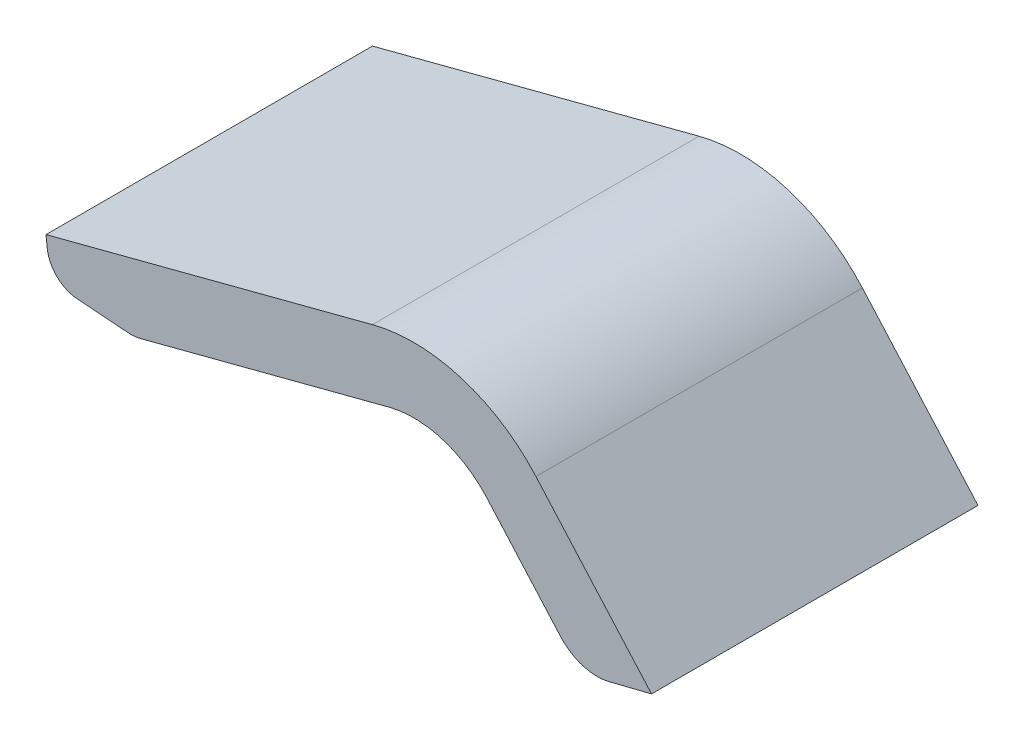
from build123d import *

# Parameters (mm, degrees)
EXTRUSION1_DEPTH = 20


with BuildPart() as part:
    # Esquisse1 → Extrusion1 (new body)
    with BuildSketch(Plane.XY):
        with BuildLine():
            Line((-18.577280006, 1.266396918), (1.422719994, 6.486173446))
            ThreePointArc((1.422719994, 6.486173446), (6.859028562, 6.37720615), (11.434687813, 3.43974685))
            Line((11.434687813, 3.43974685), (18.516024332, -4.557221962))
            Line((18.516024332, -4.557221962), (15.90364925, -5.207823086))
            ThreePointArc((15.90364925, -5.207823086), (14.289276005, -5.161878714), (12.932656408, -4.285582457))
            Line((12.932656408, -4.285582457), (8.44002044, 0.787961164))
            ThreePointArc((8.44002044, 0.787961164), (5.694624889, 2.550436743), (2.432839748, 2.615817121))
            Line((2.432839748, 2.615817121), (-12.829653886, -1.36752318))
            ThreePointArc((-12.829653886, -1.36752318), (-13.154140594, -1.42417667), (-13.483525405, -1.426801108))
            Line((-13.483525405, -1.426801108), (-16.663149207, -1.18956097))
            ThreePointArc((-16.663149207, -1.18956097), (-17.903407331, -0.634022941), (-18.502310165, 0.585886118))
            Line((-18.502310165, 0.585886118), (-18.577280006, 1.266396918))
        make_face()
    extrude(amount=EXTRUSION1_DEPTH)


solid = part.part
